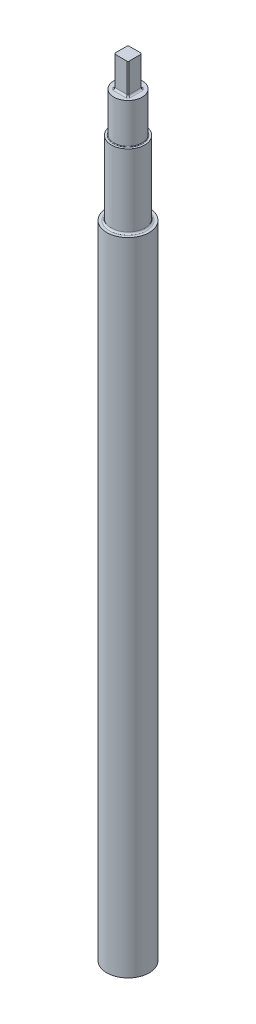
ISO-10303-21;
HEADER;
FILE_DESCRIPTION(('STEP AP214'),'2;1');
FILE_NAME('part.step','',(''),(''),'','','');
FILE_SCHEMA(('AUTOMOTIVE_DESIGN { 1 0 10303 214 1 1 1 1 }'));
ENDSEC;
DATA;
#1=APPLICATION_CONTEXT('core data for automotive mechanical design processes');
#2=APPLICATION_PROTOCOL_DEFINITION('international standard','automotive_design',2000,#1);
#3=PRODUCT_CONTEXT('',#1,'mechanical');
#4=PRODUCT('Part','Part','',(#3));
#5=PRODUCT_RELATED_PRODUCT_CATEGORY('part','',(#4));
#6=PRODUCT_DEFINITION_FORMATION('','',#4);
#7=PRODUCT_DEFINITION_CONTEXT('part definition',#1,'design');
#8=PRODUCT_DEFINITION('design','',#6,#7);
#9=PRODUCT_DEFINITION_SHAPE('','',#8);
#10=(LENGTH_UNIT() NAMED_UNIT(*) SI_UNIT(.MILLI.,.METRE.));
#11=(NAMED_UNIT(*) PLANE_ANGLE_UNIT() SI_UNIT($,.RADIAN.));
#12=(NAMED_UNIT(*) SI_UNIT($,.STERADIAN.) SOLID_ANGLE_UNIT());
#13=UNCERTAINTY_MEASURE_WITH_UNIT(LENGTH_MEASURE(1.E-05),#10,'distance_accuracy_value','');
#14=(GEOMETRIC_REPRESENTATION_CONTEXT(3) GLOBAL_UNCERTAINTY_ASSIGNED_CONTEXT((#13)) GLOBAL_UNIT_ASSIGNED_CONTEXT((#10,
#11,#12)) REPRESENTATION_CONTEXT('',''));
#15=CARTESIAN_POINT('',(0.,0.,0.));
#16=DIRECTION('',(0.,0.,1.));
#17=DIRECTION('',(1.,0.,0.));
#18=AXIS2_PLACEMENT_3D('',#15,#16,#17);
#19=CARTESIAN_POINT('',(0.,-13.6906,0.));
#20=DIRECTION('',(0.,1.,0.));
#21=DIRECTION('',(0.,0.,1.));
#22=AXIS2_PLACEMENT_3D('',#19,#20,#21);
#23=CYLINDRICAL_SURFACE('',#22,4.191);
#24=DIRECTION('',(0.,1.,0.));
#25=VECTOR('',#24,1.);
#26=CARTESIAN_POINT('',(-2.7648690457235,-13.6906,-3.1496));
#27=LINE('',#26,#25);
#28=CARTESIAN_POINT('',(-2.7648690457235,-12.9286,-3.1496));
#29=VERTEX_POINT('',#28);
#30=CARTESIAN_POINT('',(-2.7648690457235,0.,-3.1496));
#31=VERTEX_POINT('',#30);
#32=EDGE_CURVE('E157',#29,#31,#27,.T.);
#33=ORIENTED_EDGE('',*,*,#32,.F.);
#34=CARTESIAN_POINT('',(0.,-12.9286,0.));
#35=DIRECTION('',(0.,-1.,0.));
#36=DIRECTION('',(0.,0.,-1.));
#37=AXIS2_PLACEMENT_3D('',#34,#35,#36);
#38=CIRCLE('',#37,4.191);
#39=CARTESIAN_POINT('',(-3.1496,-12.9286,-2.76486904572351));
#40=VERTEX_POINT('',#39);
#41=EDGE_CURVE('E42',#29,#40,#38,.F.);
#42=ORIENTED_EDGE('',*,*,#41,.T.);
#43=DIRECTION('',(0.,1.,0.));
#44=VECTOR('',#43,1.);
#45=CARTESIAN_POINT('',(-3.1496,-13.6906,-2.76486904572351));
#46=LINE('',#45,#44);
#47=CARTESIAN_POINT('',(-3.1496,0.,-2.76486904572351));
#48=VERTEX_POINT('',#47);
#49=EDGE_CURVE('E115',#40,#48,#46,.T.);
#50=ORIENTED_EDGE('',*,*,#49,.T.);
#51=CARTESIAN_POINT('',(0.,0.,0.));
#52=DIRECTION('',(0.,1.,0.));
#53=DIRECTION('',(0.,0.,1.));
#54=AXIS2_PLACEMENT_3D('',#51,#52,#53);
#55=CIRCLE('',#54,4.191);
#56=EDGE_CURVE('E118',#31,#48,#55,.T.);
#57=ORIENTED_EDGE('',*,*,#56,.F.);
#58=EDGE_LOOP('',(#33,#42,#50,#57));
#59=FACE_BOUND('',#58,.T.);
#60=ADVANCED_FACE('F28',(#59),#23,.T.);
#61=CARTESIAN_POINT('',(-2.7648690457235,-13.6906,-3.1496));
#62=DIRECTION('',(0.,0.,-1.));
#63=DIRECTION('',(-1.,0.,0.));
#64=AXIS2_PLACEMENT_3D('',#61,#62,#63);
#65=PLANE('',#64);
#66=DIRECTION('',(0.,1.,0.));
#67=VECTOR('',#66,1.);
#68=CARTESIAN_POINT('',(2.7648690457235,-13.6906,-3.1496));
#69=LINE('',#68,#67);
#70=CARTESIAN_POINT('',(2.7648690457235,-12.9286,-3.1496));
#71=VERTEX_POINT('',#70);
#72=CARTESIAN_POINT('',(2.7648690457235,0.,-3.1496));
#73=VERTEX_POINT('',#72);
#74=EDGE_CURVE('E160',#71,#73,#69,.T.);
#75=ORIENTED_EDGE('',*,*,#74,.F.);
#76=DIRECTION('',(-1.,0.,0.));
#77=VECTOR('',#76,1.);
#78=CARTESIAN_POINT('',(-2.7648690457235,-12.9286,-3.1496));
#79=LINE('',#78,#77);
#80=EDGE_CURVE('E50',#71,#29,#79,.T.);
#81=ORIENTED_EDGE('',*,*,#80,.T.);
#82=ORIENTED_EDGE('',*,*,#32,.T.);
#83=DIRECTION('',(-1.,0.,0.));
#84=VECTOR('',#83,1.);
#85=CARTESIAN_POINT('',(-2.7648690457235,0.,-3.1496));
#86=LINE('',#85,#84);
#87=EDGE_CURVE('E123',#73,#31,#86,.T.);
#88=ORIENTED_EDGE('',*,*,#87,.F.);
#89=EDGE_LOOP('',(#75,#81,#82,#88));
#90=FACE_BOUND('',#89,.T.);
#91=ADVANCED_FACE('F226',(#90),#65,.T.);
#92=CARTESIAN_POINT('',(0.,-13.6906,0.));
#93=DIRECTION('',(0.,1.,0.));
#94=DIRECTION('',(0.,0.,1.));
#95=AXIS2_PLACEMENT_3D('',#92,#93,#94);
#96=CYLINDRICAL_SURFACE('',#95,4.191);
#97=DIRECTION('',(0.,1.,0.));
#98=VECTOR('',#97,1.);
#99=CARTESIAN_POINT('',(3.1496,-13.6906,-2.76486904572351));
#100=LINE('',#99,#98);
#101=CARTESIAN_POINT('',(3.1496,-12.9286,-2.76486904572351));
#102=VERTEX_POINT('',#101);
#103=CARTESIAN_POINT('',(3.1496,0.,-2.76486904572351));
#104=VERTEX_POINT('',#103);
#105=EDGE_CURVE('E162',#102,#104,#100,.T.);
#106=ORIENTED_EDGE('',*,*,#105,.F.);
#107=CARTESIAN_POINT('',(0.,-12.9286,0.));
#108=DIRECTION('',(0.,-1.,0.));
#109=DIRECTION('',(0.,0.,-1.));
#110=AXIS2_PLACEMENT_3D('',#107,#108,#109);
#111=CIRCLE('',#110,4.191);
#112=EDGE_CURVE('E194',#102,#71,#111,.F.);
#113=ORIENTED_EDGE('',*,*,#112,.T.);
#114=ORIENTED_EDGE('',*,*,#74,.T.);
#115=CARTESIAN_POINT('',(0.,0.,0.));
#116=DIRECTION('',(0.,1.,0.));
#117=DIRECTION('',(0.,0.,1.));
#118=AXIS2_PLACEMENT_3D('',#115,#116,#117);
#119=CIRCLE('',#118,4.191);
#120=EDGE_CURVE('E154',#104,#73,#119,.T.);
#121=ORIENTED_EDGE('',*,*,#120,.F.);
#122=EDGE_LOOP('',(#106,#113,#114,#121));
#123=FACE_BOUND('',#122,.T.);
#124=ADVANCED_FACE('F230',(#123),#96,.T.);
#125=CARTESIAN_POINT('',(3.1496,-13.6906,2.76486904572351));
#126=DIRECTION('',(1.,0.,0.));
#127=DIRECTION('',(0.,0.,-1.));
#128=AXIS2_PLACEMENT_3D('',#125,#126,#127);
#129=PLANE('',#128);
#130=DIRECTION('',(0.,1.,0.));
#131=VECTOR('',#130,1.);
#132=CARTESIAN_POINT('',(3.1496,-13.6906,2.76486904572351));
#133=LINE('',#132,#131);
#134=CARTESIAN_POINT('',(3.1496,-12.9286,2.76486904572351));
#135=VERTEX_POINT('',#134);
#136=CARTESIAN_POINT('',(3.1496,0.,2.76486904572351));
#137=VERTEX_POINT('',#136);
#138=EDGE_CURVE('E164',#135,#137,#133,.T.);
#139=ORIENTED_EDGE('',*,*,#138,.F.);
#140=DIRECTION('',(0.,0.,-1.));
#141=VECTOR('',#140,1.);
#142=CARTESIAN_POINT('',(3.1496,-12.9286,2.76486904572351));
#143=LINE('',#142,#141);
#144=EDGE_CURVE('E192',#135,#102,#143,.T.);
#145=ORIENTED_EDGE('',*,*,#144,.T.);
#146=ORIENTED_EDGE('',*,*,#105,.T.);
#147=DIRECTION('',(0.,0.,-1.));
#148=VECTOR('',#147,1.);
#149=CARTESIAN_POINT('',(3.1496,0.,2.76486904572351));
#150=LINE('',#149,#148);
#151=EDGE_CURVE('E151',#137,#104,#150,.T.);
#152=ORIENTED_EDGE('',*,*,#151,.F.);
#153=EDGE_LOOP('',(#139,#145,#146,#152));
#154=FACE_BOUND('',#153,.T.);
#155=ADVANCED_FACE('F235',(#154),#129,.T.);
#156=CARTESIAN_POINT('',(0.,-13.6906,0.));
#157=DIRECTION('',(0.,1.,0.));
#158=DIRECTION('',(0.,0.,1.));
#159=AXIS2_PLACEMENT_3D('',#156,#157,#158);
#160=CYLINDRICAL_SURFACE('',#159,4.191);
#161=DIRECTION('',(0.,1.,0.));
#162=VECTOR('',#161,1.);
#163=CARTESIAN_POINT('',(2.7648690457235,-13.6906,3.1496));
#164=LINE('',#163,#162);
#165=CARTESIAN_POINT('',(2.7648690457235,-12.9286,3.1496));
#166=VERTEX_POINT('',#165);
#167=CARTESIAN_POINT('',(2.7648690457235,0.,3.1496));
#168=VERTEX_POINT('',#167);
#169=EDGE_CURVE('E166',#166,#168,#164,.T.);
#170=ORIENTED_EDGE('',*,*,#169,.F.);
#171=CARTESIAN_POINT('',(0.,-12.9286,0.));
#172=DIRECTION('',(0.,-1.,0.));
#173=DIRECTION('',(0.,0.,-1.));
#174=AXIS2_PLACEMENT_3D('',#171,#172,#173);
#175=CIRCLE('',#174,4.191);
#176=EDGE_CURVE('E190',#166,#135,#175,.F.);
#177=ORIENTED_EDGE('',*,*,#176,.T.);
#178=ORIENTED_EDGE('',*,*,#138,.T.);
#179=CARTESIAN_POINT('',(0.,0.,0.));
#180=DIRECTION('',(0.,1.,0.));
#181=DIRECTION('',(0.,0.,1.));
#182=AXIS2_PLACEMENT_3D('',#179,#180,#181);
#183=CIRCLE('',#182,4.191);
#184=EDGE_CURVE('E148',#168,#137,#183,.T.);
#185=ORIENTED_EDGE('',*,*,#184,.F.);
#186=EDGE_LOOP('',(#170,#177,#178,#185));
#187=FACE_BOUND('',#186,.T.);
#188=ADVANCED_FACE('F243',(#187),#160,.T.);
#189=CARTESIAN_POINT('',(2.7648690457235,-13.6906,3.1496));
#190=DIRECTION('',(0.,0.,1.));
#191=DIRECTION('',(1.,0.,0.));
#192=AXIS2_PLACEMENT_3D('',#189,#190,#191);
#193=PLANE('',#192);
#194=DIRECTION('',(0.,1.,0.));
#195=VECTOR('',#194,1.);
#196=CARTESIAN_POINT('',(-2.7648690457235,-13.6906,3.1496));
#197=LINE('',#196,#195);
#198=CARTESIAN_POINT('',(-2.7648690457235,-12.9286,3.1496));
#199=VERTEX_POINT('',#198);
#200=CARTESIAN_POINT('',(-2.7648690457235,0.,3.1496));
#201=VERTEX_POINT('',#200);
#202=EDGE_CURVE('E168',#199,#201,#197,.T.);
#203=ORIENTED_EDGE('',*,*,#202,.F.);
#204=DIRECTION('',(1.,0.,0.));
#205=VECTOR('',#204,1.);
#206=CARTESIAN_POINT('',(2.7648690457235,-12.9286,3.1496));
#207=LINE('',#206,#205);
#208=EDGE_CURVE('E159',#199,#166,#207,.T.);
#209=ORIENTED_EDGE('',*,*,#208,.T.);
#210=ORIENTED_EDGE('',*,*,#169,.T.);
#211=DIRECTION('',(1.,0.,0.));
#212=VECTOR('',#211,1.);
#213=CARTESIAN_POINT('',(2.7648690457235,0.,3.1496));
#214=LINE('',#213,#212);
#215=EDGE_CURVE('E145',#201,#168,#214,.T.);
#216=ORIENTED_EDGE('',*,*,#215,.F.);
#217=EDGE_LOOP('',(#203,#209,#210,#216));
#218=FACE_BOUND('',#217,.T.);
#219=ADVANCED_FACE('F247',(#218),#193,.T.);
#220=CARTESIAN_POINT('',(0.,-13.6906,0.));
#221=DIRECTION('',(0.,1.,0.));
#222=DIRECTION('',(0.,0.,1.));
#223=AXIS2_PLACEMENT_3D('',#220,#221,#222);
#224=CYLINDRICAL_SURFACE('',#223,4.191);
#225=DIRECTION('',(0.,1.,0.));
#226=VECTOR('',#225,1.);
#227=CARTESIAN_POINT('',(-3.1496,-13.6906,2.7648690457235));
#228=LINE('',#227,#226);
#229=CARTESIAN_POINT('',(-3.1496,-12.9286,2.7648690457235));
#230=VERTEX_POINT('',#229);
#231=CARTESIAN_POINT('',(-3.1496,0.,2.7648690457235));
#232=VERTEX_POINT('',#231);
#233=EDGE_CURVE('E122',#230,#232,#228,.T.);
#234=ORIENTED_EDGE('',*,*,#233,.F.);
#235=CARTESIAN_POINT('',(0.,-12.9286,0.));
#236=DIRECTION('',(0.,-1.,0.));
#237=DIRECTION('',(0.,0.,-1.));
#238=AXIS2_PLACEMENT_3D('',#235,#236,#237);
#239=CIRCLE('',#238,4.191);
#240=EDGE_CURVE('E196',#230,#199,#239,.F.);
#241=ORIENTED_EDGE('',*,*,#240,.T.);
#242=ORIENTED_EDGE('',*,*,#202,.T.);
#243=CARTESIAN_POINT('',(0.,0.,0.));
#244=DIRECTION('',(0.,1.,0.));
#245=DIRECTION('',(0.,0.,1.));
#246=AXIS2_PLACEMENT_3D('',#243,#244,#245);
#247=CIRCLE('',#246,4.191);
#248=EDGE_CURVE('E132',#232,#201,#247,.T.);
#249=ORIENTED_EDGE('',*,*,#248,.F.);
#250=EDGE_LOOP('',(#234,#241,#242,#249));
#251=FACE_BOUND('',#250,.T.);
#252=ADVANCED_FACE('F251',(#251),#224,.T.);
#253=CARTESIAN_POINT('',(-3.1496,-13.6906,2.76486904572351));
#254=DIRECTION('',(-1.,0.,0.));
#255=DIRECTION('',(0.,0.,1.));
#256=AXIS2_PLACEMENT_3D('',#253,#254,#255);
#257=PLANE('',#256);
#258=ORIENTED_EDGE('',*,*,#49,.F.);
#259=DIRECTION('',(0.,0.,1.));
#260=VECTOR('',#259,1.);
#261=CARTESIAN_POINT('',(-3.1496,-12.9286,2.76486904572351));
#262=LINE('',#261,#260);
#263=EDGE_CURVE('E200',#40,#230,#262,.T.);
#264=ORIENTED_EDGE('',*,*,#263,.T.);
#265=ORIENTED_EDGE('',*,*,#233,.T.);
#266=DIRECTION('',(0.,0.,1.));
#267=VECTOR('',#266,1.);
#268=CARTESIAN_POINT('',(-3.1496,0.,2.76486904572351));
#269=LINE('',#268,#267);
#270=EDGE_CURVE('E126',#48,#232,#269,.T.);
#271=ORIENTED_EDGE('',*,*,#270,.F.);
#272=EDGE_LOOP('',(#258,#264,#265,#271));
#273=FACE_BOUND('',#272,.T.);
#274=ADVANCED_FACE('F127',(#273),#257,.T.);
#275=CARTESIAN_POINT('',(0.,0.,0.));
#276=DIRECTION('',(0.,1.,0.));
#277=DIRECTION('',(0.,0.,1.));
#278=AXIS2_PLACEMENT_3D('',#275,#276,#277);
#279=PLANE('',#278);
#280=ORIENTED_EDGE('',*,*,#56,.T.);
#281=ORIENTED_EDGE('',*,*,#270,.T.);
#282=ORIENTED_EDGE('',*,*,#248,.T.);
#283=ORIENTED_EDGE('',*,*,#215,.T.);
#284=ORIENTED_EDGE('',*,*,#184,.T.);
#285=ORIENTED_EDGE('',*,*,#151,.T.);
#286=ORIENTED_EDGE('',*,*,#120,.T.);
#287=ORIENTED_EDGE('',*,*,#87,.T.);
#288=EDGE_LOOP('',(#280,#281,#282,#283,#284,#285,#286,#287));
#289=FACE_BOUND('',#288,.T.);
#290=ADVANCED_FACE('F134',(#289),#279,.T.);
#291=CARTESIAN_POINT('',(0.,-31.6738,0.));
#292=DIRECTION('',(0.,1.,0.));
#293=DIRECTION('',(0.,0.,1.));
#294=AXIS2_PLACEMENT_3D('',#291,#292,#293);
#295=CYLINDRICAL_SURFACE('',#294,6.35);
#296=CARTESIAN_POINT('',(0.,-31.4198,0.));
#297=DIRECTION('',(0.,-1.,0.));
#298=DIRECTION('',(0.,0.,-1.));
#299=AXIS2_PLACEMENT_3D('',#296,#297,#298);
#300=CIRCLE('',#299,6.35);
#301=CARTESIAN_POINT('',(0.,-31.4198,-6.35));
#302=VERTEX_POINT('',#301);
#303=EDGE_CURVE('E205',#302,#302,#300,.F.);
#304=ORIENTED_EDGE('',*,*,#303,.T.);
#305=EDGE_LOOP('',(#304));
#306=FACE_BOUND('',#305,.T.);
#307=CARTESIAN_POINT('',(0.,-13.6906,0.));
#308=DIRECTION('',(0.,-1.,0.));
#309=DIRECTION('',(0.,0.,-1.));
#310=AXIS2_PLACEMENT_3D('',#307,#308,#309);
#311=CIRCLE('',#310,6.35);
#312=CARTESIAN_POINT('',(0.,-13.6906,-6.35));
#313=VERTEX_POINT('',#312);
#314=EDGE_CURVE('E137',#313,#313,#311,.T.);
#315=ORIENTED_EDGE('',*,*,#314,.T.);
#316=EDGE_LOOP('',(#315));
#317=FACE_BOUND('',#316,.T.);
#318=ADVANCED_FACE('F259',(#306,#317),#295,.T.);
#319=CARTESIAN_POINT('',(0.,-13.6906,0.));
#320=DIRECTION('',(0.,-1.,0.));
#321=DIRECTION('',(0.,0.,-1.));
#322=AXIS2_PLACEMENT_3D('',#319,#320,#321);
#323=PLANE('',#322);
#324=CARTESIAN_POINT('',(0.,-13.6906,0.));
#325=DIRECTION('',(0.,-1.,0.));
#326=DIRECTION('',(0.,0.,-1.));
#327=AXIS2_PLACEMENT_3D('',#324,#325,#326);
#328=CIRCLE('',#327,4.953);
#329=CARTESIAN_POINT('',(3.9116,-13.6906,3.03835390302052));
#330=VERTEX_POINT('',#329);
#331=CARTESIAN_POINT('',(3.03835390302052,-13.6906,3.9116));
#332=VERTEX_POINT('',#331);
#333=EDGE_CURVE('E185',#330,#332,#328,.T.);
#334=ORIENTED_EDGE('',*,*,#333,.T.);
#335=DIRECTION('',(1.,0.,0.));
#336=VECTOR('',#335,1.);
#337=CARTESIAN_POINT('',(0.,-13.6906,3.9116));
#338=LINE('',#337,#336);
#339=CARTESIAN_POINT('',(-3.03835390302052,-13.6906,3.9116));
#340=VERTEX_POINT('',#339);
#341=EDGE_CURVE('E187',#332,#340,#338,.F.);
#342=ORIENTED_EDGE('',*,*,#341,.T.);
#343=CARTESIAN_POINT('',(0.,-13.6906,0.));
#344=DIRECTION('',(0.,-1.,0.));
#345=DIRECTION('',(0.,0.,-1.));
#346=AXIS2_PLACEMENT_3D('',#343,#344,#345);
#347=CIRCLE('',#346,4.953);
#348=CARTESIAN_POINT('',(-3.9116,-13.6906,3.03835390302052));
#349=VERTEX_POINT('',#348);
#350=EDGE_CURVE('E179',#340,#349,#347,.T.);
#351=ORIENTED_EDGE('',*,*,#350,.T.);
#352=DIRECTION('',(0.,0.,1.));
#353=VECTOR('',#352,1.);
#354=CARTESIAN_POINT('',(-3.9116,-13.6906,0.));
#355=LINE('',#354,#353);
#356=CARTESIAN_POINT('',(-3.9116,-13.6906,-3.03835390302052));
#357=VERTEX_POINT('',#356);
#358=EDGE_CURVE('E173',#349,#357,#355,.F.);
#359=ORIENTED_EDGE('',*,*,#358,.T.);
#360=CARTESIAN_POINT('',(0.,-13.6906,0.));
#361=DIRECTION('',(0.,-1.,0.));
#362=DIRECTION('',(0.,0.,-1.));
#363=AXIS2_PLACEMENT_3D('',#360,#361,#362);
#364=CIRCLE('',#363,4.953);
#365=CARTESIAN_POINT('',(-3.03835390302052,-13.6906,-3.9116));
#366=VERTEX_POINT('',#365);
#367=EDGE_CURVE('E175',#357,#366,#364,.T.);
#368=ORIENTED_EDGE('',*,*,#367,.T.);
#369=DIRECTION('',(-1.,0.,0.));
#370=VECTOR('',#369,1.);
#371=CARTESIAN_POINT('',(0.,-13.6906,-3.9116));
#372=LINE('',#371,#370);
#373=CARTESIAN_POINT('',(3.03835390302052,-13.6906,-3.9116));
#374=VERTEX_POINT('',#373);
#375=EDGE_CURVE('E177',#366,#374,#372,.F.);
#376=ORIENTED_EDGE('',*,*,#375,.T.);
#377=CARTESIAN_POINT('',(0.,-13.6906,0.));
#378=DIRECTION('',(0.,-1.,0.));
#379=DIRECTION('',(0.,0.,-1.));
#380=AXIS2_PLACEMENT_3D('',#377,#378,#379);
#381=CIRCLE('',#380,4.953);
#382=CARTESIAN_POINT('',(3.9116,-13.6906,-3.03835390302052));
#383=VERTEX_POINT('',#382);
#384=EDGE_CURVE('E181',#374,#383,#381,.T.);
#385=ORIENTED_EDGE('',*,*,#384,.T.);
#386=DIRECTION('',(0.,0.,-1.));
#387=VECTOR('',#386,1.);
#388=CARTESIAN_POINT('',(3.9116,-13.6906,0.));
#389=LINE('',#388,#387);
#390=EDGE_CURVE('E183',#383,#330,#389,.F.);
#391=ORIENTED_EDGE('',*,*,#390,.T.);
#392=EDGE_LOOP('',(#334,#342,#351,#359,#368,#376,#385,#391));
#393=FACE_BOUND('',#392,.T.);
#394=ORIENTED_EDGE('',*,*,#314,.F.);
#395=EDGE_LOOP('',(#394));
#396=FACE_BOUND('',#395,.T.);
#397=ADVANCED_FACE('F263',(#393,#396),#323,.F.);
#398=CARTESIAN_POINT('',(0.,-31.6738,0.));
#399=DIRECTION('',(0.,-1.,0.));
#400=DIRECTION('',(0.,0.,-1.));
#401=AXIS2_PLACEMENT_3D('',#398,#399,#400);
#402=PLANE('',#401);
#403=CARTESIAN_POINT('',(0.,-31.6738,0.));
#404=DIRECTION('',(0.,-1.,0.));
#405=DIRECTION('',(0.,0.,-1.));
#406=AXIS2_PLACEMENT_3D('',#403,#404,#405);
#407=CIRCLE('',#406,6.604);
#408=CARTESIAN_POINT('',(0.,-31.6738,-6.604));
#409=VERTEX_POINT('',#408);
#410=EDGE_CURVE('E202',#409,#409,#407,.T.);
#411=ORIENTED_EDGE('',*,*,#410,.T.);
#412=EDGE_LOOP('',(#411));
#413=FACE_BOUND('',#412,.T.);
#414=CARTESIAN_POINT('',(0.,-31.6738,0.));
#415=DIRECTION('',(0.,-1.,0.));
#416=DIRECTION('',(0.,0.,-1.));
#417=AXIS2_PLACEMENT_3D('',#414,#415,#416);
#418=CIRCLE('',#417,7.50062);
#419=CARTESIAN_POINT('',(0.,-31.6738,-7.50062));
#420=VERTEX_POINT('',#419);
#421=EDGE_CURVE('E140',#420,#420,#418,.T.);
#422=ORIENTED_EDGE('',*,*,#421,.F.);
#423=EDGE_LOOP('',(#422));
#424=FACE_BOUND('',#423,.T.);
#425=ADVANCED_FACE('F268',(#413,#424),#402,.F.);
#426=CARTESIAN_POINT('',(0.,-64.6684,0.));
#427=DIRECTION('',(0.,1.,0.));
#428=DIRECTION('',(0.,0.,1.));
#429=AXIS2_PLACEMENT_3D('',#426,#427,#428);
#430=CYLINDRICAL_SURFACE('',#429,7.50062);
#431=CARTESIAN_POINT('',(0.,-63.9064,0.));
#432=DIRECTION('',(0.,-1.,0.));
#433=DIRECTION('',(0.,0.,-1.));
#434=AXIS2_PLACEMENT_3D('',#431,#432,#433);
#435=CIRCLE('',#434,7.50062);
#436=CARTESIAN_POINT('',(0.,-63.9064,-7.50062));
#437=VERTEX_POINT('',#436);
#438=EDGE_CURVE('E11',#437,#437,#435,.F.);
#439=ORIENTED_EDGE('',*,*,#438,.T.);
#440=EDGE_LOOP('',(#439));
#441=FACE_BOUND('',#440,.T.);
#442=ORIENTED_EDGE('',*,*,#421,.T.);
#443=EDGE_LOOP('',(#442));
#444=FACE_BOUND('',#443,.T.);
#445=ADVANCED_FACE('F273',(#441,#444),#430,.T.);
#446=CARTESIAN_POINT('',(0.,-64.6684,0.));
#447=DIRECTION('',(0.,-1.,0.));
#448=DIRECTION('',(0.,0.,-1.));
#449=AXIS2_PLACEMENT_3D('',#446,#447,#448);
#450=PLANE('',#449);
#451=CARTESIAN_POINT('',(0.,-64.6684,0.));
#452=DIRECTION('',(0.,-1.,0.));
#453=DIRECTION('',(0.,0.,-1.));
#454=AXIS2_PLACEMENT_3D('',#451,#452,#453);
#455=CIRCLE('',#454,8.26262);
#456=CARTESIAN_POINT('',(0.,-64.6684,-8.26262));
#457=VERTEX_POINT('',#456);
#458=EDGE_CURVE('E35',#457,#457,#455,.T.);
#459=ORIENTED_EDGE('',*,*,#458,.T.);
#460=EDGE_LOOP('',(#459));
#461=FACE_BOUND('',#460,.T.);
#462=CARTESIAN_POINT('',(0.,-64.6684,0.));
#463=DIRECTION('',(0.,-1.,0.));
#464=DIRECTION('',(0.,0.,-1.));
#465=AXIS2_PLACEMENT_3D('',#462,#463,#464);
#466=CIRCLE('',#465,9.4996);
#467=CARTESIAN_POINT('',(0.,-64.6684,-9.4996));
#468=VERTEX_POINT('',#467);
#469=EDGE_CURVE('E312',#468,#468,#466,.T.);
#470=ORIENTED_EDGE('',*,*,#469,.F.);
#471=EDGE_LOOP('',(#470));
#472=FACE_BOUND('',#471,.T.);
#473=ADVANCED_FACE('F210',(#461,#472),#450,.F.);
#474=CARTESIAN_POINT('',(0.,-351.9424,0.));
#475=DIRECTION('',(0.,1.,0.));
#476=DIRECTION('',(0.,0.,1.));
#477=AXIS2_PLACEMENT_3D('',#474,#475,#476);
#478=CYLINDRICAL_SURFACE('',#477,9.4996);
#479=CARTESIAN_POINT('',(0.,-351.9424,0.));
#480=DIRECTION('',(0.,-1.,0.));
#481=DIRECTION('',(0.,0.,-1.));
#482=AXIS2_PLACEMENT_3D('',#479,#480,#481);
#483=CIRCLE('',#482,9.4996);
#484=CARTESIAN_POINT('',(0.,-351.9424,-9.4996));
#485=VERTEX_POINT('',#484);
#486=EDGE_CURVE('E315',#485,#485,#483,.T.);
#487=ORIENTED_EDGE('',*,*,#486,.F.);
#488=EDGE_LOOP('',(#487));
#489=FACE_BOUND('',#488,.T.);
#490=ORIENTED_EDGE('',*,*,#469,.T.);
#491=EDGE_LOOP('',(#490));
#492=FACE_BOUND('',#491,.T.);
#493=ADVANCED_FACE('F280',(#489,#492),#478,.T.);
#494=CARTESIAN_POINT('',(0.,-351.9424,0.));
#495=DIRECTION('',(0.,-1.,0.));
#496=DIRECTION('',(0.,0.,-1.));
#497=AXIS2_PLACEMENT_3D('',#494,#495,#496);
#498=PLANE('',#497);
#499=ORIENTED_EDGE('',*,*,#486,.T.);
#500=EDGE_LOOP('',(#499));
#501=FACE_BOUND('',#500,.T.);
#502=ADVANCED_FACE('F283',(#501),#498,.T.);
#503=CARTESIAN_POINT('',(-2.7648690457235,-12.9286,-3.9116));
#504=DIRECTION('',(-1.,0.,0.));
#505=DIRECTION('',(0.,0.,1.));
#506=AXIS2_PLACEMENT_3D('',#503,#504,#505);
#507=CYLINDRICAL_SURFACE('',#506,0.762);
#508=CARTESIAN_POINT('',(2.7648690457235,-12.9286,-3.1496));
#509=CARTESIAN_POINT('',(2.76486866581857,-12.9490722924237,-3.14959944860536));
#510=CARTESIAN_POINT('',(2.76518002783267,-12.9695343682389,-3.15042559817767));
#511=CARTESIAN_POINT('',(2.76641933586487,-13.0103036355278,-3.15371682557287));
#512=CARTESIAN_POINT('',(2.76734716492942,-13.0306108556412,-3.1561815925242));
#513=CARTESIAN_POINT('',(2.77103677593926,-13.090972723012,-3.16599023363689));
#514=CARTESIAN_POINT('',(2.77470478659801,-13.1306089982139,-3.17574867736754));
#515=CARTESIAN_POINT('',(2.78429006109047,-13.2075435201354,-3.20133214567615));
#516=CARTESIAN_POINT('',(2.79020685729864,-13.2448422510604,-3.21715590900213));
#517=CARTESIAN_POINT('',(2.80403899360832,-13.3161943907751,-3.25430817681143));
#518=CARTESIAN_POINT('',(2.81195498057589,-13.3502467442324,-3.27563846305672));
#519=CARTESIAN_POINT('',(2.8297292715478,-13.4152156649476,-3.3237818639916));
#520=CARTESIAN_POINT('',(2.83963608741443,-13.4460166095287,-3.35073272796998));
#521=CARTESIAN_POINT('',(2.86088989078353,-13.5026997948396,-3.40890348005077));
#522=CARTESIAN_POINT('',(2.87223737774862,-13.5285803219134,-3.44012484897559));
#523=CARTESIAN_POINT('',(2.89673129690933,-13.5763198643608,-3.50796023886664));
#524=CARTESIAN_POINT('',(2.90994483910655,-13.5978440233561,-3.54478551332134));
#525=CARTESIAN_POINT('',(2.9371844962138,-13.6343904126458,-3.62125674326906));
#526=CARTESIAN_POINT('',(2.95121066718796,-13.6494121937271,-3.66090289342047));
#527=CARTESIAN_POINT('',(2.97707675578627,-13.6705499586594,-3.73455740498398));
#528=CARTESIAN_POINT('',(2.98884843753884,-13.6777910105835,-3.76827399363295));
#529=CARTESIAN_POINT('',(3.01245876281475,-13.6876465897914,-3.83630452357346));
#530=CARTESIAN_POINT('',(3.02429722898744,-13.690270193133,-3.87061715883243));
#531=CARTESIAN_POINT('',(3.03683001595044,-13.6905902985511,-3.90715478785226));
#532=CARTESIAN_POINT('',(3.03759211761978,-13.6906000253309,-3.90937743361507));
#533=CARTESIAN_POINT('',(3.03835390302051,-13.6906,-3.9116));
#534=B_SPLINE_CURVE_WITH_KNOTS('',3,(#508,#509,#510,#511,#512,#513,#514,#515,#516,#517,#518,
#519,#520,#521,#522,#523,#524,#525,#526,#527,#528,#529,#530,#531,#532,#533),.UNSPECIFIED.,.F.,
.F.,(4,2,2,2,2,2,2,2,2,2,2,2,4),(0.,0.0613777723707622,0.122743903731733,0.245057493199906,
0.367345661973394,0.4896734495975,0.615453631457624,0.741277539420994,0.874657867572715,
1.00804740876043,1.11709026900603,1.22591855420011,1.23296753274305),.UNSPECIFIED.);
#535=EDGE_CURVE('E300',#374,#71,#534,.F.);
#536=ORIENTED_EDGE('',*,*,#535,.F.);
#537=ORIENTED_EDGE('',*,*,#375,.F.);
#538=CARTESIAN_POINT('',(-2.7648690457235,-12.9286,-3.1496));
#539=CARTESIAN_POINT('',(-2.76486866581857,-12.9490722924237,-3.14959944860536));
#540=CARTESIAN_POINT('',(-2.76518002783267,-12.9695343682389,-3.15042559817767));
#541=CARTESIAN_POINT('',(-2.76641933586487,-13.0103036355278,-3.15371682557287));
#542=CARTESIAN_POINT('',(-2.76734716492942,-13.0306108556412,-3.1561815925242));
#543=CARTESIAN_POINT('',(-2.77103677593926,-13.090972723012,-3.16599023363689));
#544=CARTESIAN_POINT('',(-2.77470478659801,-13.1306089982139,-3.17574867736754));
#545=CARTESIAN_POINT('',(-2.78429006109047,-13.2075435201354,-3.20133214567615));
#546=CARTESIAN_POINT('',(-2.79020685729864,-13.2448422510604,-3.21715590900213));
#547=CARTESIAN_POINT('',(-2.80403899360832,-13.3161943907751,-3.25430817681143));
#548=CARTESIAN_POINT('',(-2.81195498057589,-13.3502467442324,-3.27563846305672));
#549=CARTESIAN_POINT('',(-2.8297292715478,-13.4152156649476,-3.3237818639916));
#550=CARTESIAN_POINT('',(-2.83963608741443,-13.4460166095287,-3.35073272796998));
#551=CARTESIAN_POINT('',(-2.86088989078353,-13.5026997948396,-3.40890348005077));
#552=CARTESIAN_POINT('',(-2.87223737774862,-13.5285803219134,-3.44012484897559));
#553=CARTESIAN_POINT('',(-2.89673129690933,-13.5763198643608,-3.50796023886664));
#554=CARTESIAN_POINT('',(-2.90994483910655,-13.5978440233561,-3.54478551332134));
#555=CARTESIAN_POINT('',(-2.9371844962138,-13.6343904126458,-3.62125674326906));
#556=CARTESIAN_POINT('',(-2.95121066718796,-13.6494121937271,-3.66090289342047));
#557=CARTESIAN_POINT('',(-2.97707675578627,-13.6705499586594,-3.73455740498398));
#558=CARTESIAN_POINT('',(-2.98884843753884,-13.6777910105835,-3.76827399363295));
#559=CARTESIAN_POINT('',(-3.01245876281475,-13.6876465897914,-3.83630452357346));
#560=CARTESIAN_POINT('',(-3.02429722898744,-13.690270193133,-3.87061715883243));
#561=CARTESIAN_POINT('',(-3.03683001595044,-13.6905902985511,-3.90715478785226));
#562=CARTESIAN_POINT('',(-3.03759211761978,-13.6906000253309,-3.90937743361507));
#563=CARTESIAN_POINT('',(-3.03835390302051,-13.6906,-3.9116));
#564=B_SPLINE_CURVE_WITH_KNOTS('',3,(#538,#539,#540,#541,#542,#543,#544,#545,#546,#547,#548,
#549,#550,#551,#552,#553,#554,#555,#556,#557,#558,#559,#560,#561,#562,#563),.UNSPECIFIED.,.F.,
.F.,(4,2,2,2,2,2,2,2,2,2,2,2,4),(0.,0.0613777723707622,0.122743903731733,0.245057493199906,
0.367345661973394,0.4896734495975,0.615453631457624,0.741277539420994,0.874657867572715,
1.00804740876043,1.11709026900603,1.22591855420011,1.23296753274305),.UNSPECIFIED.);
#565=EDGE_CURVE('E306',#29,#366,#564,.T.);
#566=ORIENTED_EDGE('',*,*,#565,.F.);
#567=ORIENTED_EDGE('',*,*,#80,.F.);
#568=EDGE_LOOP('',(#536,#537,#566,#567));
#569=FACE_BOUND('',#568,.T.);
#570=ADVANCED_FACE('F287',(#569),#507,.F.);
#571=CARTESIAN_POINT('',(0.,-12.9286,0.));
#572=DIRECTION('',(0.,-1.,0.));
#573=DIRECTION('',(0.,0.,-1.));
#574=AXIS2_PLACEMENT_3D('',#571,#572,#573);
#575=TOROIDAL_SURFACE('',#574,4.953,0.762);
#576=ORIENTED_EDGE('',*,*,#565,.T.);
#577=ORIENTED_EDGE('',*,*,#367,.F.);
#578=CARTESIAN_POINT('',(-3.1496,-12.9286,-2.76486904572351));
#579=CARTESIAN_POINT('',(-3.14959944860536,-12.9490722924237,-2.76486866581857));
#580=CARTESIAN_POINT('',(-3.15042559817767,-12.9695343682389,-2.76518002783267));
#581=CARTESIAN_POINT('',(-3.15371682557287,-13.0103036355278,-2.76641933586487));
#582=CARTESIAN_POINT('',(-3.1561815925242,-13.0306108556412,-2.76734716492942));
#583=CARTESIAN_POINT('',(-3.16599023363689,-13.090972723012,-2.77103677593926));
#584=CARTESIAN_POINT('',(-3.17574867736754,-13.1306089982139,-2.77470478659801));
#585=CARTESIAN_POINT('',(-3.20133214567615,-13.2075435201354,-2.78429006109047));
#586=CARTESIAN_POINT('',(-3.21715590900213,-13.2448422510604,-2.79020685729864));
#587=CARTESIAN_POINT('',(-3.25430817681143,-13.3161943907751,-2.80403899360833));
#588=CARTESIAN_POINT('',(-3.27563846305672,-13.3502467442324,-2.81195498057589));
#589=CARTESIAN_POINT('',(-3.3237818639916,-13.4152156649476,-2.8297292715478));
#590=CARTESIAN_POINT('',(-3.35073272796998,-13.4460166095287,-2.83963608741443));
#591=CARTESIAN_POINT('',(-3.40890348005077,-13.5026997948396,-2.86088989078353));
#592=CARTESIAN_POINT('',(-3.44012484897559,-13.5285803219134,-2.87223737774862));
#593=CARTESIAN_POINT('',(-3.50796023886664,-13.5763198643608,-2.89673129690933));
#594=CARTESIAN_POINT('',(-3.54478551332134,-13.5978440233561,-2.90994483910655));
#595=CARTESIAN_POINT('',(-3.62125674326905,-13.6343904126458,-2.9371844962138));
#596=CARTESIAN_POINT('',(-3.66090289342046,-13.6494121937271,-2.95121066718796));
#597=CARTESIAN_POINT('',(-3.73455740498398,-13.6705499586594,-2.97707675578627));
#598=CARTESIAN_POINT('',(-3.76827399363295,-13.6777910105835,-2.98884843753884));
#599=CARTESIAN_POINT('',(-3.83630452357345,-13.6876465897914,-3.01245876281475));
#600=CARTESIAN_POINT('',(-3.87061715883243,-13.690270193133,-3.02429722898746));
#601=CARTESIAN_POINT('',(-3.90715478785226,-13.6905902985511,-3.03683001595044));
#602=CARTESIAN_POINT('',(-3.90937743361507,-13.6906000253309,-3.03759211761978));
#603=CARTESIAN_POINT('',(-3.9116,-13.6906,-3.03835390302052));
#604=B_SPLINE_CURVE_WITH_KNOTS('',3,(#578,#579,#580,#581,#582,#583,#584,#585,#586,#587,#588,
#589,#590,#591,#592,#593,#594,#595,#596,#597,#598,#599,#600,#601,#602,#603),.UNSPECIFIED.,.F.,
.F.,(4,2,2,2,2,2,2,2,2,2,2,2,4),(0.,0.0613777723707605,0.122743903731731,0.245057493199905,
0.367345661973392,0.4896734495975,0.615453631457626,0.741277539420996,0.874657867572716,
1.00804740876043,1.11709026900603,1.22591855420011,1.23296753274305),.UNSPECIFIED.);
#605=EDGE_CURVE('E328',#40,#357,#604,.T.);
#606=ORIENTED_EDGE('',*,*,#605,.F.);
#607=ORIENTED_EDGE('',*,*,#41,.F.);
#608=EDGE_LOOP('',(#576,#577,#606,#607));
#609=FACE_BOUND('',#608,.T.);
#610=ADVANCED_FACE('F294',(#609),#575,.F.);
#611=CARTESIAN_POINT('',(0.,-12.9286,0.));
#612=DIRECTION('',(0.,-1.,0.));
#613=DIRECTION('',(0.,0.,-1.));
#614=AXIS2_PLACEMENT_3D('',#611,#612,#613);
#615=TOROIDAL_SURFACE('',#614,4.953,0.762);
#616=ORIENTED_EDGE('',*,*,#535,.T.);
#617=ORIENTED_EDGE('',*,*,#112,.F.);
#618=CARTESIAN_POINT('',(3.1496,-12.9286,-2.76486904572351));
#619=CARTESIAN_POINT('',(3.14959944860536,-12.9490722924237,-2.76486866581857));
#620=CARTESIAN_POINT('',(3.15042559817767,-12.9695343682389,-2.76518002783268));
#621=CARTESIAN_POINT('',(3.15371682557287,-13.0103036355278,-2.76641933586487));
#622=CARTESIAN_POINT('',(3.1561815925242,-13.0306108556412,-2.76734716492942));
#623=CARTESIAN_POINT('',(3.16599023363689,-13.090972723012,-2.77103677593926));
#624=CARTESIAN_POINT('',(3.17574867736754,-13.1306089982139,-2.77470478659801));
#625=CARTESIAN_POINT('',(3.20133214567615,-13.2075435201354,-2.78429006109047));
#626=CARTESIAN_POINT('',(3.21715590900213,-13.2448422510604,-2.79020685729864));
#627=CARTESIAN_POINT('',(3.25430817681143,-13.3161943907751,-2.80403899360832));
#628=CARTESIAN_POINT('',(3.27563846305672,-13.3502467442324,-2.81195498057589));
#629=CARTESIAN_POINT('',(3.3237818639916,-13.4152156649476,-2.8297292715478));
#630=CARTESIAN_POINT('',(3.35073272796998,-13.4460166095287,-2.83963608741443));
#631=CARTESIAN_POINT('',(3.40890348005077,-13.5026997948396,-2.86088989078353));
#632=CARTESIAN_POINT('',(3.44012484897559,-13.5285803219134,-2.87223737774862));
#633=CARTESIAN_POINT('',(3.50796023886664,-13.5763198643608,-2.89673129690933));
#634=CARTESIAN_POINT('',(3.54478551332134,-13.5978440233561,-2.90994483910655));
#635=CARTESIAN_POINT('',(3.62125674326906,-13.6343904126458,-2.9371844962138));
#636=CARTESIAN_POINT('',(3.66090289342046,-13.6494121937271,-2.95121066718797));
#637=CARTESIAN_POINT('',(3.73455740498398,-13.6705499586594,-2.97707675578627));
#638=CARTESIAN_POINT('',(3.76827399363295,-13.6777910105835,-2.98884843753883));
#639=CARTESIAN_POINT('',(3.83630452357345,-13.6876465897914,-3.01245876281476));
#640=CARTESIAN_POINT('',(3.87061715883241,-13.690270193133,-3.02429722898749));
#641=CARTESIAN_POINT('',(3.90715478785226,-13.6905902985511,-3.03683001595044));
#642=CARTESIAN_POINT('',(3.90937743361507,-13.6906000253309,-3.03759211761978));
#643=CARTESIAN_POINT('',(3.9116,-13.6906,-3.03835390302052));
#644=B_SPLINE_CURVE_WITH_KNOTS('',3,(#618,#619,#620,#621,#622,#623,#624,#625,#626,#627,#628,
#629,#630,#631,#632,#633,#634,#635,#636,#637,#638,#639,#640,#641,#642,#643),.UNSPECIFIED.,.F.,
.F.,(4,2,2,2,2,2,2,2,2,2,2,2,4),(0.,0.0613777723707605,0.122743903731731,0.245057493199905,
0.367345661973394,0.4896734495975,0.615453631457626,0.741277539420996,0.874657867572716,
1.00804740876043,1.11709026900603,1.22591855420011,1.23296753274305),.UNSPECIFIED.);
#645=EDGE_CURVE('E334',#383,#102,#644,.F.);
#646=ORIENTED_EDGE('',*,*,#645,.F.);
#647=ORIENTED_EDGE('',*,*,#384,.F.);
#648=EDGE_LOOP('',(#616,#617,#646,#647));
#649=FACE_BOUND('',#648,.T.);
#650=ADVANCED_FACE('F354',(#649),#615,.F.);
#651=CARTESIAN_POINT('',(-3.9116,-12.9286,2.76486904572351));
#652=DIRECTION('',(0.,0.,1.));
#653=DIRECTION('',(1.,0.,0.));
#654=AXIS2_PLACEMENT_3D('',#651,#652,#653);
#655=CYLINDRICAL_SURFACE('',#654,0.762);
#656=ORIENTED_EDGE('',*,*,#605,.T.);
#657=ORIENTED_EDGE('',*,*,#358,.F.);
#658=CARTESIAN_POINT('',(-3.1496,-12.9286,2.7648690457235));
#659=CARTESIAN_POINT('',(-3.14959944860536,-12.9490722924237,2.76486866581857));
#660=CARTESIAN_POINT('',(-3.15042559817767,-12.9695343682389,2.76518002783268));
#661=CARTESIAN_POINT('',(-3.15371682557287,-13.0103036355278,2.76641933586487));
#662=CARTESIAN_POINT('',(-3.1561815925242,-13.0306108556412,2.76734716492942));
#663=CARTESIAN_POINT('',(-3.16599023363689,-13.090972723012,2.77103677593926));
#664=CARTESIAN_POINT('',(-3.17574867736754,-13.1306089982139,2.77470478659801));
#665=CARTESIAN_POINT('',(-3.20133214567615,-13.2075435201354,2.78429006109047));
#666=CARTESIAN_POINT('',(-3.21715590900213,-13.2448422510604,2.79020685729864));
#667=CARTESIAN_POINT('',(-3.25430817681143,-13.3161943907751,2.80403899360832));
#668=CARTESIAN_POINT('',(-3.27563846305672,-13.3502467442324,2.81195498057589));
#669=CARTESIAN_POINT('',(-3.3237818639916,-13.4152156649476,2.8297292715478));
#670=CARTESIAN_POINT('',(-3.35073272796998,-13.4460166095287,2.83963608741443));
#671=CARTESIAN_POINT('',(-3.40890348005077,-13.5026997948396,2.86088989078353));
#672=CARTESIAN_POINT('',(-3.44012484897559,-13.5285803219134,2.87223737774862));
#673=CARTESIAN_POINT('',(-3.50796023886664,-13.5763198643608,2.89673129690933));
#674=CARTESIAN_POINT('',(-3.54478551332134,-13.5978440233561,2.90994483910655));
#675=CARTESIAN_POINT('',(-3.62125674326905,-13.6343904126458,2.9371844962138));
#676=CARTESIAN_POINT('',(-3.66090289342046,-13.6494121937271,2.95121066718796));
#677=CARTESIAN_POINT('',(-3.73455740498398,-13.6705499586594,2.97707675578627));
#678=CARTESIAN_POINT('',(-3.76827399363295,-13.6777910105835,2.98884843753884));
#679=CARTESIAN_POINT('',(-3.83630452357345,-13.6876465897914,3.01245876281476));
#680=CARTESIAN_POINT('',(-3.87061715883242,-13.690270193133,3.02429722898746));
#681=CARTESIAN_POINT('',(-3.90715478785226,-13.6905902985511,3.03683001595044));
#682=CARTESIAN_POINT('',(-3.90937743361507,-13.6906000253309,3.03759211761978));
#683=CARTESIAN_POINT('',(-3.9116,-13.6906,3.03835390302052));
#684=B_SPLINE_CURVE_WITH_KNOTS('',3,(#658,#659,#660,#661,#662,#663,#664,#665,#666,#667,#668,
#669,#670,#671,#672,#673,#674,#675,#676,#677,#678,#679,#680,#681,#682,#683),.UNSPECIFIED.,.F.,
.F.,(4,2,2,2,2,2,2,2,2,2,2,2,4),(0.,0.0613777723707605,0.122743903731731,0.245057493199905,
0.367345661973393,0.4896734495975,0.615453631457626,0.741277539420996,0.874657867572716,
1.00804740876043,1.11709026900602,1.22591855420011,1.23296753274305),.UNSPECIFIED.);
#685=EDGE_CURVE('E339',#230,#349,#684,.T.);
#686=ORIENTED_EDGE('',*,*,#685,.F.);
#687=ORIENTED_EDGE('',*,*,#263,.F.);
#688=EDGE_LOOP('',(#656,#657,#686,#687));
#689=FACE_BOUND('',#688,.T.);
#690=ADVANCED_FACE('F350',(#689),#655,.F.);
#691=CARTESIAN_POINT('',(3.9116,-12.9286,2.76486904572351));
#692=DIRECTION('',(0.,0.,-1.));
#693=DIRECTION('',(-1.,0.,0.));
#694=AXIS2_PLACEMENT_3D('',#691,#692,#693);
#695=CYLINDRICAL_SURFACE('',#694,0.762);
#696=ORIENTED_EDGE('',*,*,#645,.T.);
#697=ORIENTED_EDGE('',*,*,#144,.F.);
#698=CARTESIAN_POINT('',(3.1496,-12.9286,2.76486904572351));
#699=CARTESIAN_POINT('',(3.14959944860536,-12.9490722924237,2.76486866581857));
#700=CARTESIAN_POINT('',(3.15042559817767,-12.9695343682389,2.76518002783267));
#701=CARTESIAN_POINT('',(3.15371682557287,-13.0103036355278,2.76641933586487));
#702=CARTESIAN_POINT('',(3.1561815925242,-13.0306108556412,2.76734716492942));
#703=CARTESIAN_POINT('',(3.16599023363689,-13.090972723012,2.77103677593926));
#704=CARTESIAN_POINT('',(3.17574867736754,-13.1306089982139,2.77470478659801));
#705=CARTESIAN_POINT('',(3.20133214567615,-13.2075435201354,2.78429006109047));
#706=CARTESIAN_POINT('',(3.21715590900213,-13.2448422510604,2.79020685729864));
#707=CARTESIAN_POINT('',(3.25430817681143,-13.3161943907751,2.80403899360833));
#708=CARTESIAN_POINT('',(3.27563846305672,-13.3502467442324,2.81195498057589));
#709=CARTESIAN_POINT('',(3.3237818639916,-13.4152156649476,2.8297292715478));
#710=CARTESIAN_POINT('',(3.35073272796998,-13.4460166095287,2.83963608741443));
#711=CARTESIAN_POINT('',(3.40890348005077,-13.5026997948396,2.86088989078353));
#712=CARTESIAN_POINT('',(3.44012484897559,-13.5285803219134,2.87223737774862));
#713=CARTESIAN_POINT('',(3.50796023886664,-13.5763198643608,2.89673129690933));
#714=CARTESIAN_POINT('',(3.54478551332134,-13.5978440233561,2.90994483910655));
#715=CARTESIAN_POINT('',(3.62125674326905,-13.6343904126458,2.9371844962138));
#716=CARTESIAN_POINT('',(3.66090289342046,-13.6494121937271,2.95121066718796));
#717=CARTESIAN_POINT('',(3.73455740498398,-13.6705499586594,2.97707675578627));
#718=CARTESIAN_POINT('',(3.76827399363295,-13.6777910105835,2.98884843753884));
#719=CARTESIAN_POINT('',(3.83630452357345,-13.6876465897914,3.01245876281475));
#720=CARTESIAN_POINT('',(3.87061715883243,-13.690270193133,3.02429722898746));
#721=CARTESIAN_POINT('',(3.90715478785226,-13.6905902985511,3.03683001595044));
#722=CARTESIAN_POINT('',(3.90937743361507,-13.6906000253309,3.03759211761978));
#723=CARTESIAN_POINT('',(3.9116,-13.6906,3.03835390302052));
#724=B_SPLINE_CURVE_WITH_KNOTS('',3,(#698,#699,#700,#701,#702,#703,#704,#705,#706,#707,#708,
#709,#710,#711,#712,#713,#714,#715,#716,#717,#718,#719,#720,#721,#722,#723),.UNSPECIFIED.,.F.,
.F.,(4,2,2,2,2,2,2,2,2,2,2,2,4),(0.,0.0613777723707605,0.122743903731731,0.245057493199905,
0.367345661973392,0.4896734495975,0.615453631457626,0.741277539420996,0.874657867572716,
1.00804740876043,1.11709026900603,1.22591855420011,1.23296753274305),.UNSPECIFIED.);
#725=EDGE_CURVE('E364',#330,#135,#724,.F.);
#726=ORIENTED_EDGE('',*,*,#725,.F.);
#727=ORIENTED_EDGE('',*,*,#390,.F.);
#728=EDGE_LOOP('',(#696,#697,#726,#727));
#729=FACE_BOUND('',#728,.T.);
#730=ADVANCED_FACE('F353',(#729),#695,.F.);
#731=CARTESIAN_POINT('',(0.,-12.9286,0.));
#732=DIRECTION('',(0.,-1.,0.));
#733=DIRECTION('',(0.,0.,-1.));
#734=AXIS2_PLACEMENT_3D('',#731,#732,#733);
#735=TOROIDAL_SURFACE('',#734,4.953,0.762);
#736=ORIENTED_EDGE('',*,*,#685,.T.);
#737=ORIENTED_EDGE('',*,*,#350,.F.);
#738=CARTESIAN_POINT('',(-2.7648690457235,-12.9286,3.1496));
#739=CARTESIAN_POINT('',(-2.76486866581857,-12.9490722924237,3.14959944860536));
#740=CARTESIAN_POINT('',(-2.76518002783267,-12.9695343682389,3.15042559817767));
#741=CARTESIAN_POINT('',(-2.76641933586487,-13.0103036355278,3.15371682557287));
#742=CARTESIAN_POINT('',(-2.76734716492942,-13.0306108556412,3.1561815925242));
#743=CARTESIAN_POINT('',(-2.77103677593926,-13.090972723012,3.16599023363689));
#744=CARTESIAN_POINT('',(-2.77470478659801,-13.1306089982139,3.17574867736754));
#745=CARTESIAN_POINT('',(-2.78429006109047,-13.2075435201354,3.20133214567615));
#746=CARTESIAN_POINT('',(-2.79020685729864,-13.2448422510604,3.21715590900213));
#747=CARTESIAN_POINT('',(-2.80403899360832,-13.3161943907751,3.25430817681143));
#748=CARTESIAN_POINT('',(-2.81195498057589,-13.3502467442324,3.27563846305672));
#749=CARTESIAN_POINT('',(-2.8297292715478,-13.4152156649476,3.3237818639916));
#750=CARTESIAN_POINT('',(-2.83963608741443,-13.4460166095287,3.35073272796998));
#751=CARTESIAN_POINT('',(-2.86088989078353,-13.5026997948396,3.40890348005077));
#752=CARTESIAN_POINT('',(-2.87223737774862,-13.5285803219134,3.44012484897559));
#753=CARTESIAN_POINT('',(-2.89673129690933,-13.5763198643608,3.50796023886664));
#754=CARTESIAN_POINT('',(-2.90994483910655,-13.5978440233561,3.54478551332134));
#755=CARTESIAN_POINT('',(-2.9371844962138,-13.6343904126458,3.62125674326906));
#756=CARTESIAN_POINT('',(-2.95121066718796,-13.6494121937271,3.66090289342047));
#757=CARTESIAN_POINT('',(-2.97707675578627,-13.6705499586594,3.73455740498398));
#758=CARTESIAN_POINT('',(-2.98884843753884,-13.6777910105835,3.76827399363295));
#759=CARTESIAN_POINT('',(-3.01245876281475,-13.6876465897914,3.83630452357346));
#760=CARTESIAN_POINT('',(-3.02429722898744,-13.690270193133,3.87061715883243));
#761=CARTESIAN_POINT('',(-3.03683001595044,-13.6905902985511,3.90715478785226));
#762=CARTESIAN_POINT('',(-3.03759211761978,-13.6906000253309,3.90937743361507));
#763=CARTESIAN_POINT('',(-3.03835390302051,-13.6906,3.9116));
#764=B_SPLINE_CURVE_WITH_KNOTS('',3,(#738,#739,#740,#741,#742,#743,#744,#745,#746,#747,#748,
#749,#750,#751,#752,#753,#754,#755,#756,#757,#758,#759,#760,#761,#762,#763),.UNSPECIFIED.,.F.,
.F.,(4,2,2,2,2,2,2,2,2,2,2,2,4),(0.,0.0613777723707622,0.122743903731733,0.245057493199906,
0.367345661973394,0.4896734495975,0.615453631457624,0.741277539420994,0.874657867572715,
1.00804740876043,1.11709026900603,1.22591855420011,1.23296753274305),.UNSPECIFIED.);
#765=EDGE_CURVE('E378',#199,#340,#764,.T.);
#766=ORIENTED_EDGE('',*,*,#765,.F.);
#767=ORIENTED_EDGE('',*,*,#240,.F.);
#768=EDGE_LOOP('',(#736,#737,#766,#767));
#769=FACE_BOUND('',#768,.T.);
#770=ADVANCED_FACE('F370',(#769),#735,.F.);
#771=CARTESIAN_POINT('',(0.,-12.9286,0.));
#772=DIRECTION('',(0.,-1.,0.));
#773=DIRECTION('',(0.,0.,-1.));
#774=AXIS2_PLACEMENT_3D('',#771,#772,#773);
#775=TOROIDAL_SURFACE('',#774,4.953,0.762);
#776=ORIENTED_EDGE('',*,*,#725,.T.);
#777=ORIENTED_EDGE('',*,*,#176,.F.);
#778=CARTESIAN_POINT('',(2.7648690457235,-12.9286,3.1496));
#779=CARTESIAN_POINT('',(2.76486866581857,-12.9490722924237,3.14959944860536));
#780=CARTESIAN_POINT('',(2.76518002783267,-12.9695343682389,3.15042559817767));
#781=CARTESIAN_POINT('',(2.76641933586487,-13.0103036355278,3.15371682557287));
#782=CARTESIAN_POINT('',(2.76734716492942,-13.0306108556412,3.1561815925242));
#783=CARTESIAN_POINT('',(2.77103677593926,-13.090972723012,3.16599023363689));
#784=CARTESIAN_POINT('',(2.77470478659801,-13.1306089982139,3.17574867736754));
#785=CARTESIAN_POINT('',(2.78429006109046,-13.2075435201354,3.20133214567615));
#786=CARTESIAN_POINT('',(2.79020685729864,-13.2448422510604,3.21715590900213));
#787=CARTESIAN_POINT('',(2.80403899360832,-13.3161943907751,3.25430817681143));
#788=CARTESIAN_POINT('',(2.81195498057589,-13.3502467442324,3.27563846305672));
#789=CARTESIAN_POINT('',(2.82972927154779,-13.4152156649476,3.3237818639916));
#790=CARTESIAN_POINT('',(2.83963608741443,-13.4460166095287,3.35073272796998));
#791=CARTESIAN_POINT('',(2.86088989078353,-13.5026997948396,3.40890348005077));
#792=CARTESIAN_POINT('',(2.87223737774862,-13.5285803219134,3.44012484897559));
#793=CARTESIAN_POINT('',(2.89673129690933,-13.5763198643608,3.50796023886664));
#794=CARTESIAN_POINT('',(2.90994483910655,-13.5978440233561,3.54478551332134));
#795=CARTESIAN_POINT('',(2.9371844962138,-13.6343904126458,3.62125674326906));
#796=CARTESIAN_POINT('',(2.95121066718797,-13.6494121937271,3.66090289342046));
#797=CARTESIAN_POINT('',(2.97707675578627,-13.6705499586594,3.73455740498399));
#798=CARTESIAN_POINT('',(2.98884843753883,-13.6777910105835,3.76827399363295));
#799=CARTESIAN_POINT('',(3.01245876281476,-13.6876465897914,3.83630452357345));
#800=CARTESIAN_POINT('',(3.0242972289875,-13.690270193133,3.87061715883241));
#801=CARTESIAN_POINT('',(3.03683001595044,-13.6905902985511,3.90715478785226));
#802=CARTESIAN_POINT('',(3.03759211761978,-13.6906000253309,3.90937743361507));
#803=CARTESIAN_POINT('',(3.03835390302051,-13.6906,3.9116));
#804=B_SPLINE_CURVE_WITH_KNOTS('',3,(#778,#779,#780,#781,#782,#783,#784,#785,#786,#787,#788,
#789,#790,#791,#792,#793,#794,#795,#796,#797,#798,#799,#800,#801,#802,#803),.UNSPECIFIED.,.F.,
.F.,(4,2,2,2,2,2,2,2,2,2,2,2,4),(0.,0.0613777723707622,0.122743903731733,0.245057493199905,
0.367345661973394,0.4896734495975,0.615453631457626,0.741277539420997,0.874657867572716,
1.00804740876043,1.11709026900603,1.22591855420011,1.23296753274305),.UNSPECIFIED.);
#805=EDGE_CURVE('E383',#332,#166,#804,.F.);
#806=ORIENTED_EDGE('',*,*,#805,.F.);
#807=ORIENTED_EDGE('',*,*,#333,.F.);
#808=EDGE_LOOP('',(#776,#777,#806,#807));
#809=FACE_BOUND('',#808,.T.);
#810=ADVANCED_FACE('F374',(#809),#775,.F.);
#811=CARTESIAN_POINT('',(2.7648690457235,-12.9286,3.9116));
#812=DIRECTION('',(1.,0.,0.));
#813=DIRECTION('',(0.,0.,-1.));
#814=AXIS2_PLACEMENT_3D('',#811,#812,#813);
#815=CYLINDRICAL_SURFACE('',#814,0.762);
#816=ORIENTED_EDGE('',*,*,#765,.T.);
#817=ORIENTED_EDGE('',*,*,#341,.F.);
#818=ORIENTED_EDGE('',*,*,#805,.T.);
#819=ORIENTED_EDGE('',*,*,#208,.F.);
#820=EDGE_LOOP('',(#816,#817,#818,#819));
#821=FACE_BOUND('',#820,.T.);
#822=ADVANCED_FACE('F221',(#821),#815,.F.);
#823=CARTESIAN_POINT('',(0.,-31.4198,0.));
#824=DIRECTION('',(0.,-1.,0.));
#825=DIRECTION('',(0.,0.,-1.));
#826=AXIS2_PLACEMENT_3D('',#823,#824,#825);
#827=TOROIDAL_SURFACE('',#826,6.604,0.254);
#828=ORIENTED_EDGE('',*,*,#303,.F.);
#829=EDGE_LOOP('',(#828));
#830=FACE_BOUND('',#829,.T.);
#831=ORIENTED_EDGE('',*,*,#410,.F.);
#832=EDGE_LOOP('',(#831));
#833=FACE_BOUND('',#832,.T.);
#834=ADVANCED_FACE('F215',(#830,#833),#827,.F.);
#835=CARTESIAN_POINT('',(0.,-63.9064,0.));
#836=DIRECTION('',(0.,-1.,0.));
#837=DIRECTION('',(0.,0.,-1.));
#838=AXIS2_PLACEMENT_3D('',#835,#836,#837);
#839=TOROIDAL_SURFACE('',#838,8.26262,0.762);
#840=ORIENTED_EDGE('',*,*,#438,.F.);
#841=EDGE_LOOP('',(#840));
#842=FACE_BOUND('',#841,.T.);
#843=ORIENTED_EDGE('',*,*,#458,.F.);
#844=EDGE_LOOP('',(#843));
#845=FACE_BOUND('',#844,.T.);
#846=ADVANCED_FACE('F213',(#842,#845),#839,.F.);
#847=CLOSED_SHELL('',(#60,#91,#124,#155,#188,#219,#252,#274,#290,#318,#397,#425,#445,#473,#493,
#502,#570,#610,#650,#690,#730,#770,#810,#822,#834,#846));
#848=MANIFOLD_SOLID_BREP('B2',#847);
#849=ADVANCED_BREP_SHAPE_REPRESENTATION('',(#18,#848),#14);
#850=SHAPE_DEFINITION_REPRESENTATION(#9,#849);
ENDSEC;
END-ISO-10303-21;
